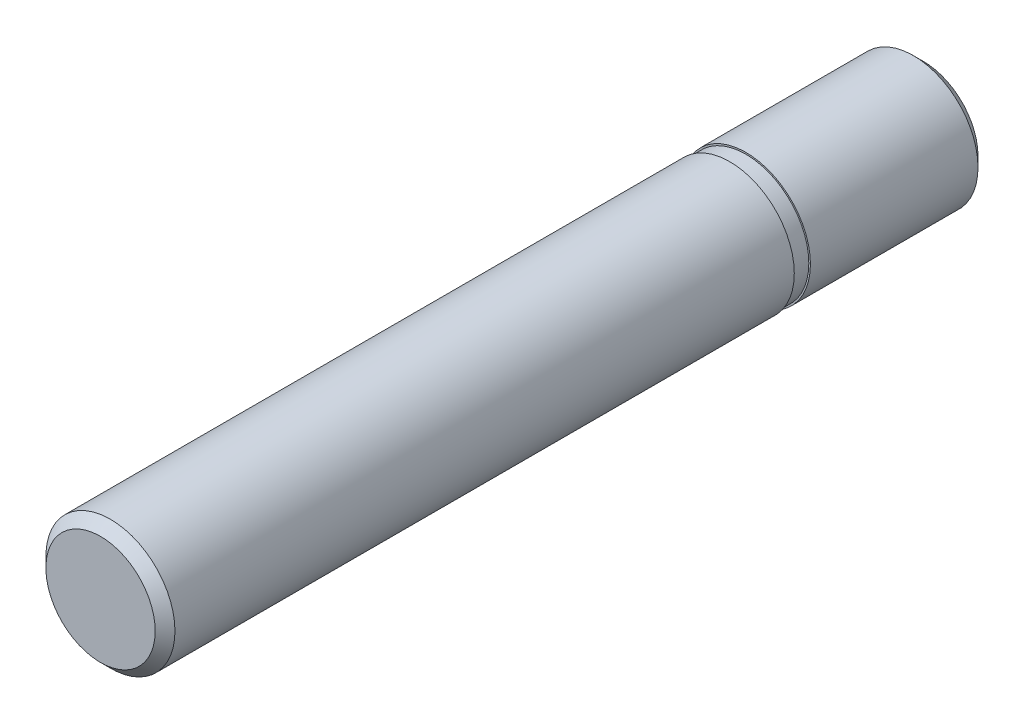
ISO-10303-21;
HEADER;
FILE_DESCRIPTION(('STEP AP214'),'2;1');
FILE_NAME('part.step','',(''),(''),'','','');
FILE_SCHEMA(('AUTOMOTIVE_DESIGN { 1 0 10303 214 1 1 1 1 }'));
ENDSEC;
DATA;
#1=APPLICATION_CONTEXT('core data for automotive mechanical design processes');
#2=APPLICATION_PROTOCOL_DEFINITION('international standard','automotive_design',2000,#1);
#3=PRODUCT_CONTEXT('',#1,'mechanical');
#4=PRODUCT('Part','Part','',(#3));
#5=PRODUCT_RELATED_PRODUCT_CATEGORY('part','',(#4));
#6=PRODUCT_DEFINITION_FORMATION('','',#4);
#7=PRODUCT_DEFINITION_CONTEXT('part definition',#1,'design');
#8=PRODUCT_DEFINITION('design','',#6,#7);
#9=PRODUCT_DEFINITION_SHAPE('','',#8);
#10=(LENGTH_UNIT() NAMED_UNIT(*) SI_UNIT(.MILLI.,.METRE.));
#11=(NAMED_UNIT(*) PLANE_ANGLE_UNIT() SI_UNIT($,.RADIAN.));
#12=(NAMED_UNIT(*) SI_UNIT($,.STERADIAN.) SOLID_ANGLE_UNIT());
#13=UNCERTAINTY_MEASURE_WITH_UNIT(LENGTH_MEASURE(1.E-05),#10,'distance_accuracy_value','');
#14=(GEOMETRIC_REPRESENTATION_CONTEXT(3) GLOBAL_UNCERTAINTY_ASSIGNED_CONTEXT((#13)) GLOBAL_UNIT_ASSIGNED_CONTEXT((#10,
#11,#12)) REPRESENTATION_CONTEXT('',''));
#15=CARTESIAN_POINT('',(0.,0.,0.));
#16=DIRECTION('',(0.,0.,1.));
#17=DIRECTION('',(1.,0.,0.));
#18=AXIS2_PLACEMENT_3D('',#15,#16,#17);
#19=CARTESIAN_POINT('',(0.,3.3865,-22.));
#20=DIRECTION('',(0.,0.,-1.));
#21=DIRECTION('',(-1.,0.,0.));
#22=AXIS2_PLACEMENT_3D('',#19,#20,#21);
#23=PLANE('',#22);
#24=CARTESIAN_POINT('',(0.,0.,-22.));
#25=DIRECTION('',(0.,0.,1.));
#26=DIRECTION('',(1.,0.,0.));
#27=AXIS2_PLACEMENT_3D('',#24,#25,#26);
#28=CIRCLE('',#27,6.773);
#29=CARTESIAN_POINT('',(6.773,0.,-22.));
#30=VERTEX_POINT('',#29);
#31=EDGE_CURVE('E19',#30,#30,#28,.T.);
#32=ORIENTED_EDGE('',*,*,#31,.F.);
#33=EDGE_LOOP('',(#32));
#34=FACE_BOUND('',#33,.T.);
#35=ADVANCED_FACE('F12',(#34),#23,.T.);
#36=CARTESIAN_POINT('',(0.,0.,-20.773));
#37=DIRECTION('',(0.,0.,1.));
#38=DIRECTION('',(1.,0.,0.));
#39=AXIS2_PLACEMENT_3D('',#36,#37,#38);
#40=CONICAL_SURFACE('',#39,8.,0.785398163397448);
#41=CARTESIAN_POINT('',(0.,0.,-20.773));
#42=DIRECTION('',(0.,0.,1.));
#43=DIRECTION('',(1.,0.,0.));
#44=AXIS2_PLACEMENT_3D('',#41,#42,#43);
#45=CIRCLE('',#44,8.);
#46=CARTESIAN_POINT('',(8.,0.,-20.773));
#47=VERTEX_POINT('',#46);
#48=EDGE_CURVE('E23',#47,#47,#45,.T.);
#49=ORIENTED_EDGE('',*,*,#48,.F.);
#50=EDGE_LOOP('',(#49));
#51=FACE_BOUND('',#50,.T.);
#52=ORIENTED_EDGE('',*,*,#31,.T.);
#53=EDGE_LOOP('',(#52));
#54=FACE_BOUND('',#53,.T.);
#55=ADVANCED_FACE('F66',(#51,#54),#40,.T.);
#56=CARTESIAN_POINT('',(0.,0.,5.));
#57=DIRECTION('',(0.,0.,1.));
#58=DIRECTION('',(1.,0.,0.));
#59=AXIS2_PLACEMENT_3D('',#56,#57,#58);
#60=CYLINDRICAL_SURFACE('',#59,8.);
#61=CARTESIAN_POINT('',(0.,0.,0.));
#62=DIRECTION('',(0.,0.,1.));
#63=DIRECTION('',(1.,0.,0.));
#64=AXIS2_PLACEMENT_3D('',#61,#62,#63);
#65=CIRCLE('',#64,8.);
#66=CARTESIAN_POINT('',(8.,0.,0.));
#67=VERTEX_POINT('',#66);
#68=EDGE_CURVE('E28',#67,#67,#65,.T.);
#69=ORIENTED_EDGE('',*,*,#68,.F.);
#70=EDGE_LOOP('',(#69));
#71=FACE_BOUND('',#70,.T.);
#72=ORIENTED_EDGE('',*,*,#48,.T.);
#73=EDGE_LOOP('',(#72));
#74=FACE_BOUND('',#73,.T.);
#75=ADVANCED_FACE('F72',(#71,#74),#60,.T.);
#76=CARTESIAN_POINT('',(0.,0.,0.));
#77=DIRECTION('',(0.,0.,1.));
#78=DIRECTION('',(1.,0.,0.));
#79=AXIS2_PLACEMENT_3D('',#76,#77,#78);
#80=PLANE('',#79);
#81=CARTESIAN_POINT('',(0.,0.,0.));
#82=DIRECTION('',(0.,0.,1.));
#83=DIRECTION('',(1.,0.,0.));
#84=AXIS2_PLACEMENT_3D('',#81,#82,#83);
#85=CIRCLE('',#84,7.8);
#86=CARTESIAN_POINT('',(7.8,0.,0.));
#87=VERTEX_POINT('',#86);
#88=EDGE_CURVE('E8',#87,#87,#85,.T.);
#89=ORIENTED_EDGE('',*,*,#88,.F.);
#90=EDGE_LOOP('',(#89));
#91=FACE_BOUND('',#90,.T.);
#92=ORIENTED_EDGE('',*,*,#68,.T.);
#93=EDGE_LOOP('',(#92));
#94=FACE_BOUND('',#93,.T.);
#95=ADVANCED_FACE('F77',(#91,#94),#80,.T.);
#96=CARTESIAN_POINT('',(0.,0.,-4.66663811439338));
#97=DIRECTION('',(0.,0.,-1.));
#98=DIRECTION('',(-1.,0.,0.));
#99=AXIS2_PLACEMENT_3D('',#96,#97,#98);
#100=CYLINDRICAL_SURFACE('',#99,7.8);
#101=CARTESIAN_POINT('',(0.,0.,2.));
#102=DIRECTION('',(0.,0.,-1.));
#103=DIRECTION('',(-1.,0.,0.));
#104=AXIS2_PLACEMENT_3D('',#101,#102,#103);
#105=CIRCLE('',#104,7.8);
#106=CARTESIAN_POINT('',(-7.8,0.,2.));
#107=VERTEX_POINT('',#106);
#108=EDGE_CURVE('E44',#107,#107,#105,.T.);
#109=ORIENTED_EDGE('',*,*,#108,.T.);
#110=EDGE_LOOP('',(#109));
#111=FACE_BOUND('',#110,.T.);
#112=ORIENTED_EDGE('',*,*,#88,.T.);
#113=EDGE_LOOP('',(#112));
#114=FACE_BOUND('',#113,.T.);
#115=ADVANCED_FACE('F51',(#111,#114),#100,.T.);
#116=CARTESIAN_POINT('',(0.,0.,80.));
#117=DIRECTION('',(0.,0.,1.));
#118=DIRECTION('',(1.,0.,0.));
#119=AXIS2_PLACEMENT_3D('',#116,#117,#118);
#120=PLANE('',#119);
#121=CARTESIAN_POINT('',(0.,0.,80.));
#122=DIRECTION('',(0.,0.,1.));
#123=DIRECTION('',(1.,0.,0.));
#124=AXIS2_PLACEMENT_3D('',#121,#122,#123);
#125=CIRCLE('',#124,6.773);
#126=CARTESIAN_POINT('',(6.773,0.,80.));
#127=VERTEX_POINT('',#126);
#128=EDGE_CURVE('E40',#127,#127,#125,.T.);
#129=ORIENTED_EDGE('',*,*,#128,.T.);
#130=EDGE_LOOP('',(#129));
#131=FACE_BOUND('',#130,.T.);
#132=ADVANCED_FACE('F85',(#131),#120,.T.);
#133=CARTESIAN_POINT('',(0.,0.,80.));
#134=DIRECTION('',(0.,0.,-1.));
#135=DIRECTION('',(-1.,0.,0.));
#136=AXIS2_PLACEMENT_3D('',#133,#134,#135);
#137=CONICAL_SURFACE('',#136,6.773,0.785398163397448);
#138=CARTESIAN_POINT('',(0.,0.,78.773));
#139=DIRECTION('',(0.,0.,1.));
#140=DIRECTION('',(1.,0.,0.));
#141=AXIS2_PLACEMENT_3D('',#138,#139,#140);
#142=CIRCLE('',#141,8.);
#143=CARTESIAN_POINT('',(8.,0.,78.773));
#144=VERTEX_POINT('',#143);
#145=EDGE_CURVE('E31',#144,#144,#142,.F.);
#146=ORIENTED_EDGE('',*,*,#145,.F.);
#147=EDGE_LOOP('',(#146));
#148=FACE_BOUND('',#147,.T.);
#149=ORIENTED_EDGE('',*,*,#128,.F.);
#150=EDGE_LOOP('',(#149));
#151=FACE_BOUND('',#150,.T.);
#152=ADVANCED_FACE('F62',(#148,#151),#137,.T.);
#153=CARTESIAN_POINT('',(0.,0.,5.));
#154=DIRECTION('',(0.,0.,1.));
#155=DIRECTION('',(1.,0.,0.));
#156=AXIS2_PLACEMENT_3D('',#153,#154,#155);
#157=CYLINDRICAL_SURFACE('',#156,8.);
#158=CARTESIAN_POINT('',(0.,0.,2.));
#159=DIRECTION('',(0.,0.,1.));
#160=DIRECTION('',(1.,0.,0.));
#161=AXIS2_PLACEMENT_3D('',#158,#159,#160);
#162=CIRCLE('',#161,8.);
#163=CARTESIAN_POINT('',(8.,0.,2.));
#164=VERTEX_POINT('',#163);
#165=EDGE_CURVE('E35',#164,#164,#162,.T.);
#166=ORIENTED_EDGE('',*,*,#165,.T.);
#167=EDGE_LOOP('',(#166));
#168=FACE_BOUND('',#167,.T.);
#169=ORIENTED_EDGE('',*,*,#145,.T.);
#170=EDGE_LOOP('',(#169));
#171=FACE_BOUND('',#170,.T.);
#172=ADVANCED_FACE('F14',(#168,#171),#157,.T.);
#173=CARTESIAN_POINT('',(0.,0.,2.));
#174=DIRECTION('',(0.,0.,1.));
#175=DIRECTION('',(1.,0.,0.));
#176=AXIS2_PLACEMENT_3D('',#173,#174,#175);
#177=PLANE('',#176);
#178=ORIENTED_EDGE('',*,*,#108,.F.);
#179=EDGE_LOOP('',(#178));
#180=FACE_BOUND('',#179,.T.);
#181=ORIENTED_EDGE('',*,*,#165,.F.);
#182=EDGE_LOOP('',(#181));
#183=FACE_BOUND('',#182,.T.);
#184=ADVANCED_FACE('F53',(#180,#183),#177,.F.);
#185=CLOSED_SHELL('',(#35,#55,#75,#95,#115,#132,#152,#172,#184));
#186=MANIFOLD_SOLID_BREP('B1',#185);
#187=ADVANCED_BREP_SHAPE_REPRESENTATION('',(#18,#186),#14);
#188=SHAPE_DEFINITION_REPRESENTATION(#9,#187);
ENDSEC;
END-ISO-10303-21;
